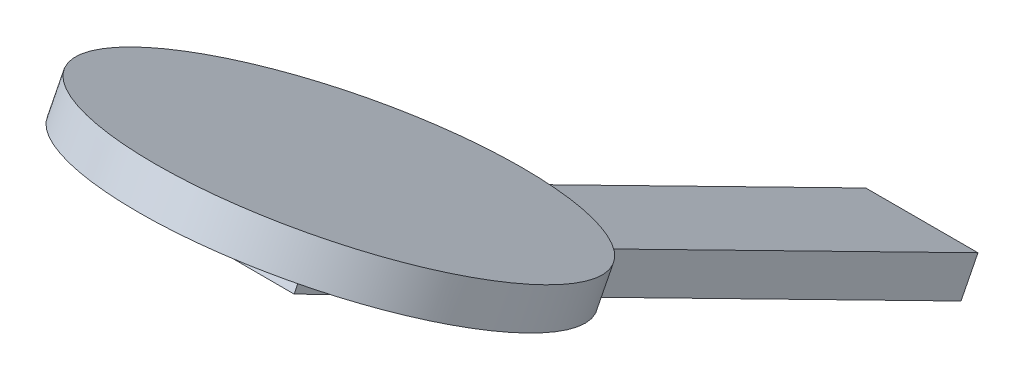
from build123d import *

# Parameters (mm, degrees)
SKIZZE2_R               = 55.087510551
LINEAR_AUSTRAGEN1_DEPTH = 10
LINEAR_AUSTRAGEN2_DEPTH = 10


with BuildPart() as part:
    # Skizze2 → Linear austragen1 (new body)
    with BuildSketch(Plane(origin=(0, 259.17740386, -131.917950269), x_dir=(-1, 0, 0), z_dir=(0, -0.8912005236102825, 0.4536095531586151))):
        with Locations(Location((0, 0, 0), (0, 0, 90))):
            Circle(SKIZZE2_R)
    extrude(amount=LINEAR_AUSTRAGEN1_DEPTH)

    # Skizze3 → Linear austragen2 (add)
    with BuildSketch(Plane(origin=(0, 250.265398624, -127.381854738), x_dir=(-1, 0, 0), z_dir=(0, -0.8912005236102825, 0.45360955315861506))):
        Polygon((-15, -20.057058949), (15, -19.943228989), (15, 180.056771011), (-15, 180.056771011), align=None)
    extrude(amount=LINEAR_AUSTRAGEN2_DEPTH)


solid = part.part
